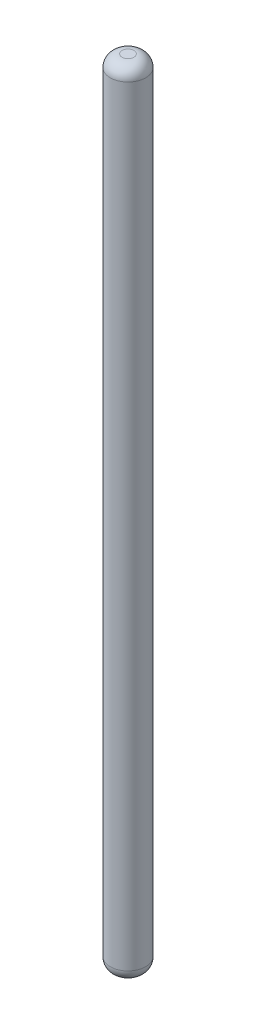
ISO-10303-21;
HEADER;
FILE_DESCRIPTION(('STEP AP214'),'2;1');
FILE_NAME('part.step','',(''),(''),'','','');
FILE_SCHEMA(('AUTOMOTIVE_DESIGN { 1 0 10303 214 1 1 1 1 }'));
ENDSEC;
DATA;
#1=APPLICATION_CONTEXT('core data for automotive mechanical design processes');
#2=APPLICATION_PROTOCOL_DEFINITION('international standard','automotive_design',2000,#1);
#3=PRODUCT_CONTEXT('',#1,'mechanical');
#4=PRODUCT('Part','Part','',(#3));
#5=PRODUCT_RELATED_PRODUCT_CATEGORY('part','',(#4));
#6=PRODUCT_DEFINITION_FORMATION('','',#4);
#7=PRODUCT_DEFINITION_CONTEXT('part definition',#1,'design');
#8=PRODUCT_DEFINITION('design','',#6,#7);
#9=PRODUCT_DEFINITION_SHAPE('','',#8);
#10=(LENGTH_UNIT() NAMED_UNIT(*) SI_UNIT(.MILLI.,.METRE.));
#11=(NAMED_UNIT(*) PLANE_ANGLE_UNIT() SI_UNIT($,.RADIAN.));
#12=(NAMED_UNIT(*) SI_UNIT($,.STERADIAN.) SOLID_ANGLE_UNIT());
#13=UNCERTAINTY_MEASURE_WITH_UNIT(LENGTH_MEASURE(1.E-05),#10,'distance_accuracy_value','');
#14=(GEOMETRIC_REPRESENTATION_CONTEXT(3) GLOBAL_UNCERTAINTY_ASSIGNED_CONTEXT((#13)) GLOBAL_UNIT_ASSIGNED_CONTEXT((#10,
#11,#12)) REPRESENTATION_CONTEXT('',''));
#15=CARTESIAN_POINT('',(0.,0.,0.));
#16=DIRECTION('',(0.,0.,1.));
#17=DIRECTION('',(1.,0.,0.));
#18=AXIS2_PLACEMENT_3D('',#15,#16,#17);
#19=CARTESIAN_POINT('',(0.,67.,0.));
#20=DIRECTION('',(0.,-1.,0.));
#21=DIRECTION('',(0.,0.,-1.));
#22=AXIS2_PLACEMENT_3D('',#19,#20,#21);
#23=CYLINDRICAL_SURFACE('',#22,1.5);
#24=CARTESIAN_POINT('',(0.,1.,0.));
#25=DIRECTION('',(0.,1.,0.));
#26=DIRECTION('',(0.,0.,1.));
#27=AXIS2_PLACEMENT_3D('',#24,#25,#26);
#28=CIRCLE('',#27,1.5);
#29=CARTESIAN_POINT('',(0.,1.,1.5));
#30=VERTEX_POINT('',#29);
#31=EDGE_CURVE('E48',#30,#30,#28,.T.);
#32=ORIENTED_EDGE('',*,*,#31,.T.);
#33=EDGE_LOOP('',(#32));
#34=FACE_BOUND('',#33,.T.);
#35=CARTESIAN_POINT('',(0.,66.,0.));
#36=DIRECTION('',(0.,1.,0.));
#37=DIRECTION('',(0.,0.,1.));
#38=AXIS2_PLACEMENT_3D('',#35,#36,#37);
#39=CIRCLE('',#38,1.5);
#40=CARTESIAN_POINT('',(0.,66.,1.5));
#41=VERTEX_POINT('',#40);
#42=EDGE_CURVE('E53',#41,#41,#39,.F.);
#43=ORIENTED_EDGE('',*,*,#42,.T.);
#44=EDGE_LOOP('',(#43));
#45=FACE_BOUND('',#44,.T.);
#46=ADVANCED_FACE('F34',(#34,#45),#23,.T.);
#47=CARTESIAN_POINT('',(0.,67.,0.));
#48=DIRECTION('',(0.,1.,0.));
#49=DIRECTION('',(0.,0.,1.));
#50=AXIS2_PLACEMENT_3D('',#47,#48,#49);
#51=PLANE('',#50);
#52=CARTESIAN_POINT('',(0.,67.,0.));
#53=DIRECTION('',(0.,1.,0.));
#54=DIRECTION('',(0.,0.,1.));
#55=AXIS2_PLACEMENT_3D('',#52,#53,#54);
#56=CIRCLE('',#55,0.5);
#57=CARTESIAN_POINT('',(0.,67.,0.5));
#58=VERTEX_POINT('',#57);
#59=EDGE_CURVE('E10',#58,#58,#56,.T.);
#60=ORIENTED_EDGE('',*,*,#59,.T.);
#61=EDGE_LOOP('',(#60));
#62=FACE_BOUND('',#61,.T.);
#63=ADVANCED_FACE('F69',(#62),#51,.T.);
#64=CARTESIAN_POINT('',(0.,0.,0.));
#65=DIRECTION('',(0.,1.,0.));
#66=DIRECTION('',(0.,0.,1.));
#67=AXIS2_PLACEMENT_3D('',#64,#65,#66);
#68=PLANE('',#67);
#69=CARTESIAN_POINT('',(0.,0.,0.));
#70=DIRECTION('',(0.,1.,0.));
#71=DIRECTION('',(0.,0.,1.));
#72=AXIS2_PLACEMENT_3D('',#69,#70,#71);
#73=CIRCLE('',#72,0.5);
#74=CARTESIAN_POINT('',(0.,0.,0.5));
#75=VERTEX_POINT('',#74);
#76=EDGE_CURVE('E42',#75,#75,#73,.F.);
#77=ORIENTED_EDGE('',*,*,#76,.T.);
#78=EDGE_LOOP('',(#77));
#79=FACE_BOUND('',#78,.T.);
#80=ADVANCED_FACE('F66',(#79),#68,.F.);
#81=CARTESIAN_POINT('',(0.,1.,0.));
#82=DIRECTION('',(0.,1.,0.));
#83=DIRECTION('',(0.,0.,1.));
#84=AXIS2_PLACEMENT_3D('',#81,#82,#83);
#85=DEGENERATE_TOROIDAL_SURFACE('',#84,0.5,1.,.T.);
#86=ORIENTED_EDGE('',*,*,#76,.F.);
#87=EDGE_LOOP('',(#86));
#88=FACE_BOUND('',#87,.T.);
#89=ORIENTED_EDGE('',*,*,#31,.F.);
#90=EDGE_LOOP('',(#89));
#91=FACE_BOUND('',#90,.T.);
#92=ADVANCED_FACE('F62',(#88,#91),#85,.T.);
#93=CARTESIAN_POINT('',(0.,66.,0.));
#94=DIRECTION('',(0.,1.,0.));
#95=DIRECTION('',(0.,0.,1.));
#96=AXIS2_PLACEMENT_3D('',#93,#94,#95);
#97=DEGENERATE_TOROIDAL_SURFACE('',#96,0.5,1.,.T.);
#98=ORIENTED_EDGE('',*,*,#42,.F.);
#99=EDGE_LOOP('',(#98));
#100=FACE_BOUND('',#99,.T.);
#101=ORIENTED_EDGE('',*,*,#59,.F.);
#102=EDGE_LOOP('',(#101));
#103=FACE_BOUND('',#102,.T.);
#104=ADVANCED_FACE('F36',(#100,#103),#97,.T.);
#105=CLOSED_SHELL('',(#46,#63,#80,#92,#104));
#106=MANIFOLD_SOLID_BREP('B2',#105);
#107=ADVANCED_BREP_SHAPE_REPRESENTATION('',(#18,#106),#14);
#108=SHAPE_DEFINITION_REPRESENTATION(#9,#107);
ENDSEC;
END-ISO-10303-21;
